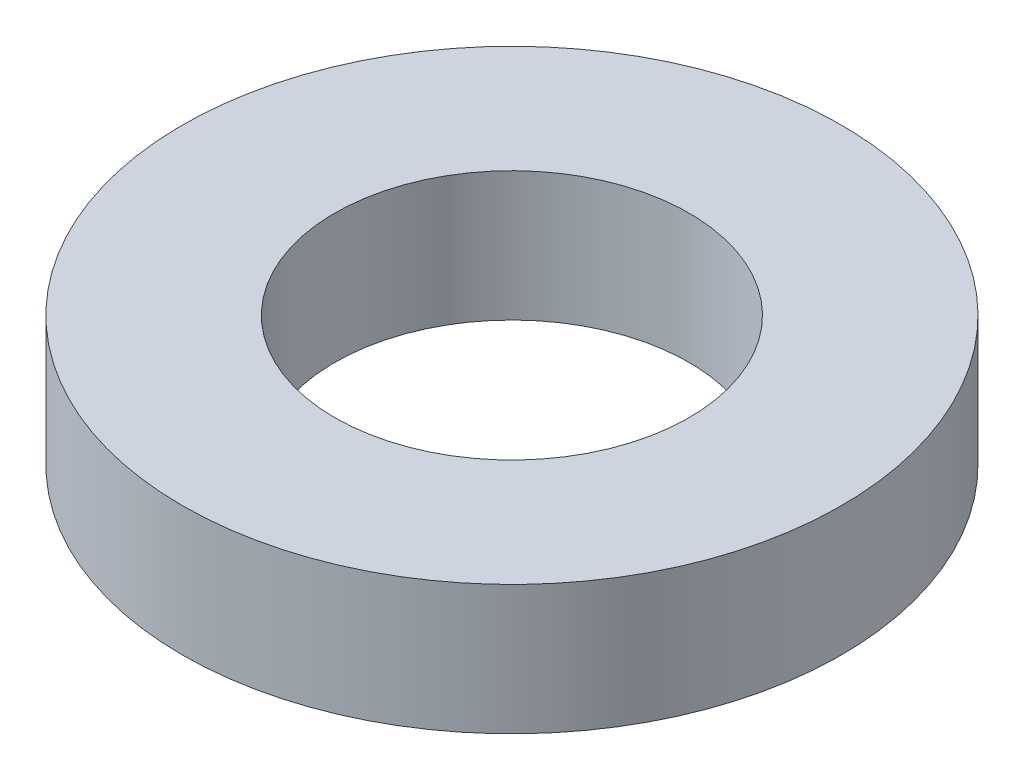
ISO-10303-21;
HEADER;
FILE_DESCRIPTION(('STEP AP214'),'2;1');
FILE_NAME('part.step','',(''),(''),'','','');
FILE_SCHEMA(('AUTOMOTIVE_DESIGN { 1 0 10303 214 1 1 1 1 }'));
ENDSEC;
DATA;
#1=APPLICATION_CONTEXT('core data for automotive mechanical design processes');
#2=APPLICATION_PROTOCOL_DEFINITION('international standard','automotive_design',2000,#1);
#3=PRODUCT_CONTEXT('',#1,'mechanical');
#4=PRODUCT('Part','Part','',(#3));
#5=PRODUCT_RELATED_PRODUCT_CATEGORY('part','',(#4));
#6=PRODUCT_DEFINITION_FORMATION('','',#4);
#7=PRODUCT_DEFINITION_CONTEXT('part definition',#1,'design');
#8=PRODUCT_DEFINITION('design','',#6,#7);
#9=PRODUCT_DEFINITION_SHAPE('','',#8);
#10=(LENGTH_UNIT() NAMED_UNIT(*) SI_UNIT(.MILLI.,.METRE.));
#11=(NAMED_UNIT(*) PLANE_ANGLE_UNIT() SI_UNIT($,.RADIAN.));
#12=(NAMED_UNIT(*) SI_UNIT($,.STERADIAN.) SOLID_ANGLE_UNIT());
#13=UNCERTAINTY_MEASURE_WITH_UNIT(LENGTH_MEASURE(1.E-05),#10,'distance_accuracy_value','');
#14=(GEOMETRIC_REPRESENTATION_CONTEXT(3) GLOBAL_UNCERTAINTY_ASSIGNED_CONTEXT((#13)) GLOBAL_UNIT_ASSIGNED_CONTEXT((#10,
#11,#12)) REPRESENTATION_CONTEXT('',''));
#15=CARTESIAN_POINT('',(0.,0.,0.));
#16=DIRECTION('',(0.,0.,1.));
#17=DIRECTION('',(1.,0.,0.));
#18=AXIS2_PLACEMENT_3D('',#15,#16,#17);
#19=CARTESIAN_POINT('',(0.,1.8542,0.));
#20=DIRECTION('',(0.,1.,0.));
#21=DIRECTION('',(0.,0.,1.));
#22=AXIS2_PLACEMENT_3D('',#19,#20,#21);
#23=PLANE('',#22);
#24=CARTESIAN_POINT('',(0.,1.8542,0.));
#25=DIRECTION('',(0.,1.,0.));
#26=DIRECTION('',(0.,0.,1.));
#27=AXIS2_PLACEMENT_3D('',#24,#25,#26);
#28=CIRCLE('',#27,4.7244);
#29=CARTESIAN_POINT('',(0.,1.8542,4.7244));
#30=VERTEX_POINT('',#29);
#31=EDGE_CURVE('E10',#30,#30,#28,.T.);
#32=ORIENTED_EDGE('',*,*,#31,.T.);
#33=EDGE_LOOP('',(#32));
#34=FACE_BOUND('',#33,.T.);
#35=CARTESIAN_POINT('',(0.,1.8542,0.));
#36=DIRECTION('',(0.,1.,0.));
#37=DIRECTION('',(0.,0.,1.));
#38=AXIS2_PLACEMENT_3D('',#35,#36,#37);
#39=CIRCLE('',#38,2.54);
#40=CARTESIAN_POINT('',(0.,1.8542,2.54));
#41=VERTEX_POINT('',#40);
#42=EDGE_CURVE('E39',#41,#41,#39,.T.);
#43=ORIENTED_EDGE('',*,*,#42,.F.);
#44=EDGE_LOOP('',(#43));
#45=FACE_BOUND('',#44,.T.);
#46=ADVANCED_FACE('F28',(#34,#45),#23,.T.);
#47=CARTESIAN_POINT('',(0.,0.,0.));
#48=DIRECTION('',(0.,1.,0.));
#49=DIRECTION('',(0.,0.,1.));
#50=AXIS2_PLACEMENT_3D('',#47,#48,#49);
#51=PLANE('',#50);
#52=CARTESIAN_POINT('',(0.,0.,0.));
#53=DIRECTION('',(0.,1.,0.));
#54=DIRECTION('',(0.,0.,1.));
#55=AXIS2_PLACEMENT_3D('',#52,#53,#54);
#56=CIRCLE('',#55,4.7244);
#57=CARTESIAN_POINT('',(0.,0.,4.7244));
#58=VERTEX_POINT('',#57);
#59=EDGE_CURVE('E35',#58,#58,#56,.T.);
#60=ORIENTED_EDGE('',*,*,#59,.F.);
#61=EDGE_LOOP('',(#60));
#62=FACE_BOUND('',#61,.T.);
#63=CARTESIAN_POINT('',(0.,0.,0.));
#64=DIRECTION('',(0.,1.,0.));
#65=DIRECTION('',(0.,0.,1.));
#66=AXIS2_PLACEMENT_3D('',#63,#64,#65);
#67=CIRCLE('',#66,2.54);
#68=CARTESIAN_POINT('',(0.,0.,2.54));
#69=VERTEX_POINT('',#68);
#70=EDGE_CURVE('E43',#69,#69,#67,.T.);
#71=ORIENTED_EDGE('',*,*,#70,.T.);
#72=EDGE_LOOP('',(#71));
#73=FACE_BOUND('',#72,.T.);
#74=ADVANCED_FACE('F49',(#62,#73),#51,.F.);
#75=CARTESIAN_POINT('',(0.,1.8542,0.));
#76=DIRECTION('',(0.,-1.,0.));
#77=DIRECTION('',(0.,0.,-1.));
#78=AXIS2_PLACEMENT_3D('',#75,#76,#77);
#79=CYLINDRICAL_SURFACE('',#78,4.7244);
#80=ORIENTED_EDGE('',*,*,#31,.F.);
#81=EDGE_LOOP('',(#80));
#82=FACE_BOUND('',#81,.T.);
#83=ORIENTED_EDGE('',*,*,#59,.T.);
#84=EDGE_LOOP('',(#83));
#85=FACE_BOUND('',#84,.T.);
#86=ADVANCED_FACE('F30',(#82,#85),#79,.T.);
#87=CARTESIAN_POINT('',(0.,1.8542,0.));
#88=DIRECTION('',(0.,-1.,0.));
#89=DIRECTION('',(0.,0.,-1.));
#90=AXIS2_PLACEMENT_3D('',#87,#88,#89);
#91=CYLINDRICAL_SURFACE('',#90,2.54);
#92=ORIENTED_EDGE('',*,*,#42,.T.);
#93=EDGE_LOOP('',(#92));
#94=FACE_BOUND('',#93,.T.);
#95=ORIENTED_EDGE('',*,*,#70,.F.);
#96=EDGE_LOOP('',(#95));
#97=FACE_BOUND('',#96,.T.);
#98=ADVANCED_FACE('F51',(#94,#97),#91,.F.);
#99=CLOSED_SHELL('',(#46,#74,#86,#98));
#100=MANIFOLD_SOLID_BREP('B2',#99);
#101=ADVANCED_BREP_SHAPE_REPRESENTATION('',(#18,#100),#14);
#102=SHAPE_DEFINITION_REPRESENTATION(#9,#101);
ENDSEC;
END-ISO-10303-21;
